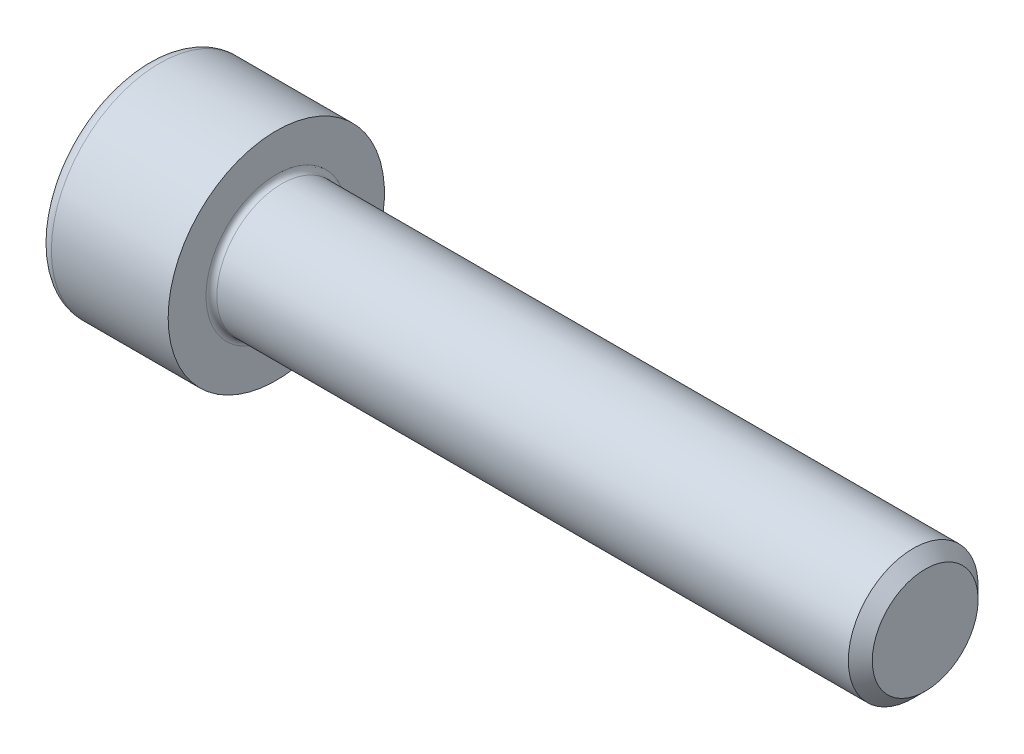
ISO-10303-21;
HEADER;
FILE_DESCRIPTION(('STEP AP214'),'2;1');
FILE_NAME('part.step','',(''),(''),'','','');
FILE_SCHEMA(('AUTOMOTIVE_DESIGN { 1 0 10303 214 1 1 1 1 }'));
ENDSEC;
DATA;
#1=APPLICATION_CONTEXT('core data for automotive mechanical design processes');
#2=APPLICATION_PROTOCOL_DEFINITION('international standard','automotive_design',2000,#1);
#3=PRODUCT_CONTEXT('',#1,'mechanical');
#4=PRODUCT('Part','Part','',(#3));
#5=PRODUCT_RELATED_PRODUCT_CATEGORY('part','',(#4));
#6=PRODUCT_DEFINITION_FORMATION('','',#4);
#7=PRODUCT_DEFINITION_CONTEXT('part definition',#1,'design');
#8=PRODUCT_DEFINITION('design','',#6,#7);
#9=PRODUCT_DEFINITION_SHAPE('','',#8);
#10=(LENGTH_UNIT() NAMED_UNIT(*) SI_UNIT(.MILLI.,.METRE.));
#11=(NAMED_UNIT(*) PLANE_ANGLE_UNIT() SI_UNIT($,.RADIAN.));
#12=(NAMED_UNIT(*) SI_UNIT($,.STERADIAN.) SOLID_ANGLE_UNIT());
#13=UNCERTAINTY_MEASURE_WITH_UNIT(LENGTH_MEASURE(1.E-05),#10,'distance_accuracy_value','');
#14=(GEOMETRIC_REPRESENTATION_CONTEXT(3) GLOBAL_UNCERTAINTY_ASSIGNED_CONTEXT((#13)) GLOBAL_UNIT_ASSIGNED_CONTEXT((#10,
#11,#12)) REPRESENTATION_CONTEXT('',''));
#15=CARTESIAN_POINT('',(0.,0.,0.));
#16=DIRECTION('',(0.,0.,1.));
#17=DIRECTION('',(1.,0.,0.));
#18=AXIS2_PLACEMENT_3D('',#15,#16,#17);
#19=CARTESIAN_POINT('',(0.,0.,0.));
#20=DIRECTION('',(-1.,0.,0.));
#21=DIRECTION('',(0.,0.,1.));
#22=AXIS2_PLACEMENT_3D('',#19,#20,#21);
#23=PLANE('',#22);
#24=DIRECTION('',(0.,-0.499999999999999,0.866025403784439));
#25=VECTOR('',#24,1.);
#26=CARTESIAN_POINT('',(0.,2.89829835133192,0.));
#27=LINE('',#26,#25);
#28=CARTESIAN_POINT('',(0.,2.89829835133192,0.));
#29=VERTEX_POINT('',#28);
#30=CARTESIAN_POINT('',(0.,1.44914917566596,2.50999999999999));
#31=VERTEX_POINT('',#30);
#32=EDGE_CURVE('E286',#29,#31,#27,.T.);
#33=ORIENTED_EDGE('',*,*,#32,.T.);
#34=DIRECTION('',(0.,1.,0.));
#35=VECTOR('',#34,1.);
#36=CARTESIAN_POINT('',(0.,-1.44914917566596,2.51));
#37=LINE('',#36,#35);
#38=CARTESIAN_POINT('',(0.,-1.44914917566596,2.51));
#39=VERTEX_POINT('',#38);
#40=EDGE_CURVE('E143',#39,#31,#37,.T.);
#41=ORIENTED_EDGE('',*,*,#40,.F.);
#42=DIRECTION('',(0.,-0.500000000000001,-0.866025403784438));
#43=VECTOR('',#42,1.);
#44=CARTESIAN_POINT('',(0.,-1.44914917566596,2.51));
#45=LINE('',#44,#43);
#46=CARTESIAN_POINT('',(0.,-2.89829835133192,0.));
#47=VERTEX_POINT('',#46);
#48=EDGE_CURVE('E291',#39,#47,#45,.T.);
#49=ORIENTED_EDGE('',*,*,#48,.T.);
#50=DIRECTION('',(0.,0.499999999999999,-0.866025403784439));
#51=VECTOR('',#50,1.);
#52=CARTESIAN_POINT('',(0.,-2.89829835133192,0.));
#53=LINE('',#52,#51);
#54=CARTESIAN_POINT('',(0.,-1.44914917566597,-2.51));
#55=VERTEX_POINT('',#54);
#56=EDGE_CURVE('E295',#47,#55,#53,.T.);
#57=ORIENTED_EDGE('',*,*,#56,.T.);
#58=DIRECTION('',(0.,-1.,0.));
#59=VECTOR('',#58,1.);
#60=CARTESIAN_POINT('',(0.,1.44914917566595,-2.51));
#61=LINE('',#60,#59);
#62=CARTESIAN_POINT('',(0.,1.44914917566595,-2.51));
#63=VERTEX_POINT('',#62);
#64=EDGE_CURVE('E299',#63,#55,#61,.T.);
#65=ORIENTED_EDGE('',*,*,#64,.F.);
#66=DIRECTION('',(0.,-0.500000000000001,-0.866025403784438));
#67=VECTOR('',#66,1.);
#68=CARTESIAN_POINT('',(0.,2.89829835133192,0.));
#69=LINE('',#68,#67);
#70=EDGE_CURVE('E138',#29,#63,#69,.T.);
#71=ORIENTED_EDGE('',*,*,#70,.F.);
#72=EDGE_LOOP('',(#33,#41,#49,#57,#65,#71));
#73=FACE_BOUND('',#72,.T.);
#74=CARTESIAN_POINT('',(0.,0.,0.));
#75=DIRECTION('',(-1.,0.,0.));
#76=DIRECTION('',(0.,0.,1.));
#77=AXIS2_PLACEMENT_3D('',#74,#75,#76);
#78=CIRCLE('',#77,4.4);
#79=CARTESIAN_POINT('',(0.,0.,4.4));
#80=VERTEX_POINT('',#79);
#81=EDGE_CURVE('E53',#80,#80,#78,.T.);
#82=ORIENTED_EDGE('',*,*,#81,.T.);
#83=EDGE_LOOP('',(#82));
#84=FACE_BOUND('',#83,.T.);
#85=ADVANCED_FACE('F44',(#73,#84),#23,.T.);
#86=CARTESIAN_POINT('',(-31.75,0.,0.));
#87=DIRECTION('',(-1.,0.,0.));
#88=DIRECTION('',(0.,0.,1.));
#89=AXIS2_PLACEMENT_3D('',#86,#87,#88);
#90=CYLINDRICAL_SURFACE('',#89,5.);
#91=CARTESIAN_POINT('',(0.600000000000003,0.,0.));
#92=DIRECTION('',(-1.,0.,0.));
#93=DIRECTION('',(0.,0.,1.));
#94=AXIS2_PLACEMENT_3D('',#91,#92,#93);
#95=CIRCLE('',#94,5.);
#96=CARTESIAN_POINT('',(0.600000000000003,0.,5.));
#97=VERTEX_POINT('',#96);
#98=EDGE_CURVE('E11',#97,#97,#95,.F.);
#99=ORIENTED_EDGE('',*,*,#98,.T.);
#100=EDGE_LOOP('',(#99));
#101=FACE_BOUND('',#100,.T.);
#102=CARTESIAN_POINT('',(6.,0.,0.));
#103=DIRECTION('',(-1.,0.,0.));
#104=DIRECTION('',(0.,0.,1.));
#105=AXIS2_PLACEMENT_3D('',#102,#103,#104);
#106=CIRCLE('',#105,5.);
#107=CARTESIAN_POINT('',(6.,0.,5.));
#108=VERTEX_POINT('',#107);
#109=EDGE_CURVE('E167',#108,#108,#106,.T.);
#110=ORIENTED_EDGE('',*,*,#109,.T.);
#111=EDGE_LOOP('',(#110));
#112=FACE_BOUND('',#111,.T.);
#113=ADVANCED_FACE('F195',(#101,#112),#90,.T.);
#114=CARTESIAN_POINT('',(6.,5.,0.));
#115=DIRECTION('',(1.,0.,0.));
#116=DIRECTION('',(0.,0.,-1.));
#117=AXIS2_PLACEMENT_3D('',#114,#115,#116);
#118=PLANE('',#117);
#119=CARTESIAN_POINT('',(6.,0.,0.));
#120=DIRECTION('',(1.,0.,0.));
#121=DIRECTION('',(0.,0.,-1.));
#122=AXIS2_PLACEMENT_3D('',#119,#120,#121);
#123=CIRCLE('',#122,3.24999999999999);
#124=CARTESIAN_POINT('',(6.,0.,-3.24999999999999));
#125=VERTEX_POINT('',#124);
#126=EDGE_CURVE('E171',#125,#125,#123,.F.);
#127=ORIENTED_EDGE('',*,*,#126,.T.);
#128=EDGE_LOOP('',(#127));
#129=FACE_BOUND('',#128,.T.);
#130=ORIENTED_EDGE('',*,*,#109,.F.);
#131=EDGE_LOOP('',(#130));
#132=FACE_BOUND('',#131,.T.);
#133=ADVANCED_FACE('F201',(#129,#132),#118,.T.);
#134=CARTESIAN_POINT('',(-31.75,0.,0.));
#135=DIRECTION('',(-1.,0.,0.));
#136=DIRECTION('',(0.,0.,1.));
#137=AXIS2_PLACEMENT_3D('',#134,#135,#136);
#138=CYLINDRICAL_SURFACE('',#137,2.99999999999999);
#139=CARTESIAN_POINT('',(6.25,0.,0.));
#140=DIRECTION('',(1.,0.,0.));
#141=DIRECTION('',(0.,0.,-1.));
#142=AXIS2_PLACEMENT_3D('',#139,#140,#141);
#143=CIRCLE('',#142,2.99999999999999);
#144=CARTESIAN_POINT('',(6.25,0.,-2.99999999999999));
#145=VERTEX_POINT('',#144);
#146=EDGE_CURVE('E175',#145,#145,#143,.T.);
#147=ORIENTED_EDGE('',*,*,#146,.T.);
#148=EDGE_LOOP('',(#147));
#149=FACE_BOUND('',#148,.T.);
#150=CARTESIAN_POINT('',(35.4455,0.,0.));
#151=DIRECTION('',(-1.,0.,0.));
#152=DIRECTION('',(0.,0.,1.));
#153=AXIS2_PLACEMENT_3D('',#150,#151,#152);
#154=CIRCLE('',#153,2.99999999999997);
#155=CARTESIAN_POINT('',(35.4455,0.,2.99999999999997));
#156=VERTEX_POINT('',#155);
#157=EDGE_CURVE('E163',#156,#156,#154,.T.);
#158=ORIENTED_EDGE('',*,*,#157,.T.);
#159=EDGE_LOOP('',(#158));
#160=FACE_BOUND('',#159,.T.);
#161=ADVANCED_FACE('F207',(#149,#160),#138,.T.);
#162=CARTESIAN_POINT('',(36.,0.,0.));
#163=DIRECTION('',(-1.,0.,0.));
#164=DIRECTION('',(0.,0.,1.));
#165=AXIS2_PLACEMENT_3D('',#162,#163,#164);
#166=CONICAL_SURFACE('',#165,2.4455,0.785398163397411);
#167=ORIENTED_EDGE('',*,*,#157,.F.);
#168=EDGE_LOOP('',(#167));
#169=FACE_BOUND('',#168,.T.);
#170=CARTESIAN_POINT('',(36.,0.,0.));
#171=DIRECTION('',(-1.,0.,0.));
#172=DIRECTION('',(0.,0.,1.));
#173=AXIS2_PLACEMENT_3D('',#170,#171,#172);
#174=CIRCLE('',#173,2.4455);
#175=CARTESIAN_POINT('',(36.,0.,2.4455));
#176=VERTEX_POINT('',#175);
#177=EDGE_CURVE('E158',#176,#176,#174,.T.);
#178=ORIENTED_EDGE('',*,*,#177,.T.);
#179=EDGE_LOOP('',(#178));
#180=FACE_BOUND('',#179,.T.);
#181=ADVANCED_FACE('F211',(#169,#180),#166,.T.);
#182=CARTESIAN_POINT('',(36.,2.4455,0.));
#183=DIRECTION('',(1.,0.,0.));
#184=DIRECTION('',(0.,0.,-1.));
#185=AXIS2_PLACEMENT_3D('',#182,#183,#184);
#186=PLANE('',#185);
#187=ORIENTED_EDGE('',*,*,#177,.F.);
#188=EDGE_LOOP('',(#187));
#189=FACE_BOUND('',#188,.T.);
#190=ADVANCED_FACE('F191',(#189),#186,.T.);
#191=CARTESIAN_POINT('',(6.25,0.,0.));
#192=DIRECTION('',(1.,0.,0.));
#193=DIRECTION('',(0.,0.,-1.));
#194=AXIS2_PLACEMENT_3D('',#191,#192,#193);
#195=TOROIDAL_SURFACE('',#194,3.24999999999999,0.25);
#196=ORIENTED_EDGE('',*,*,#146,.F.);
#197=EDGE_LOOP('',(#196));
#198=FACE_BOUND('',#197,.T.);
#199=ORIENTED_EDGE('',*,*,#126,.F.);
#200=EDGE_LOOP('',(#199));
#201=FACE_BOUND('',#200,.T.);
#202=ADVANCED_FACE('F184',(#198,#201),#195,.F.);
#203=CARTESIAN_POINT('',(0.600000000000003,0.,0.));
#204=DIRECTION('',(-1.,0.,0.));
#205=DIRECTION('',(0.,0.,1.));
#206=AXIS2_PLACEMENT_3D('',#203,#204,#205);
#207=TOROIDAL_SURFACE('',#206,4.4,0.6);
#208=ORIENTED_EDGE('',*,*,#98,.F.);
#209=EDGE_LOOP('',(#208));
#210=FACE_BOUND('',#209,.T.);
#211=ORIENTED_EDGE('',*,*,#81,.F.);
#212=EDGE_LOOP('',(#211));
#213=FACE_BOUND('',#212,.T.);
#214=ADVANCED_FACE('F46',(#210,#213),#207,.T.);
#215=CARTESIAN_POINT('',(3.,2.89829835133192,0.));
#216=DIRECTION('',(0.,-0.866025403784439,-0.499999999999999));
#217=DIRECTION('',(0.,0.499999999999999,-0.866025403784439));
#218=AXIS2_PLACEMENT_3D('',#215,#216,#217);
#219=PLANE('',#218);
#220=ORIENTED_EDGE('',*,*,#32,.F.);
#221=DIRECTION('',(-1.,0.,0.));
#222=VECTOR('',#221,1.);
#223=CARTESIAN_POINT('',(3.,2.89829835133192,0.));
#224=LINE('',#223,#222);
#225=CARTESIAN_POINT('',(3.,2.89829835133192,0.));
#226=VERTEX_POINT('',#225);
#227=EDGE_CURVE('E273',#226,#29,#224,.T.);
#228=ORIENTED_EDGE('',*,*,#227,.F.);
#229=DIRECTION('',(0.,-0.499999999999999,0.866025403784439));
#230=VECTOR('',#229,1.);
#231=CARTESIAN_POINT('',(3.,2.89829835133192,0.));
#232=LINE('',#231,#230);
#233=CARTESIAN_POINT('',(3.,2.17372376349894,1.25499999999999));
#234=VERTEX_POINT('',#233);
#235=EDGE_CURVE('E129',#226,#234,#232,.T.);
#236=ORIENTED_EDGE('',*,*,#235,.T.);
#237=CARTESIAN_POINT('',(3.,1.44914917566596,2.50999999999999));
#238=VERTEX_POINT('',#237);
#239=EDGE_CURVE('E119',#234,#238,#232,.T.);
#240=ORIENTED_EDGE('',*,*,#239,.T.);
#241=DIRECTION('',(-1.,0.,0.));
#242=VECTOR('',#241,1.);
#243=CARTESIAN_POINT('',(3.,1.44914917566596,2.50999999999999));
#244=LINE('',#243,#242);
#245=EDGE_CURVE('E134',#238,#31,#244,.T.);
#246=ORIENTED_EDGE('',*,*,#245,.T.);
#247=EDGE_LOOP('',(#220,#228,#236,#240,#246));
#248=FACE_BOUND('',#247,.T.);
#249=ADVANCED_FACE('F133',(#248),#219,.T.);
#250=CARTESIAN_POINT('',(3.,-1.44914917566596,2.51));
#251=DIRECTION('',(0.,0.,1.));
#252=DIRECTION('',(0.,-1.,0.));
#253=AXIS2_PLACEMENT_3D('',#250,#251,#252);
#254=PLANE('',#253);
#255=ORIENTED_EDGE('',*,*,#40,.T.);
#256=ORIENTED_EDGE('',*,*,#245,.F.);
#257=DIRECTION('',(0.,1.,0.));
#258=VECTOR('',#257,1.);
#259=CARTESIAN_POINT('',(3.,-1.44914917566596,2.51));
#260=LINE('',#259,#258);
#261=CARTESIAN_POINT('',(3.,0.,2.51));
#262=VERTEX_POINT('',#261);
#263=EDGE_CURVE('E116',#262,#238,#260,.T.);
#264=ORIENTED_EDGE('',*,*,#263,.F.);
#265=CARTESIAN_POINT('',(3.,-1.44914917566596,2.51));
#266=VERTEX_POINT('',#265);
#267=EDGE_CURVE('E128',#266,#262,#260,.T.);
#268=ORIENTED_EDGE('',*,*,#267,.F.);
#269=DIRECTION('',(-1.,0.,0.));
#270=VECTOR('',#269,1.);
#271=CARTESIAN_POINT('',(3.,-1.44914917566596,2.51));
#272=LINE('',#271,#270);
#273=EDGE_CURVE('E146',#266,#39,#272,.T.);
#274=ORIENTED_EDGE('',*,*,#273,.T.);
#275=EDGE_LOOP('',(#255,#256,#264,#268,#274));
#276=FACE_BOUND('',#275,.T.);
#277=ADVANCED_FACE('F140',(#276),#254,.F.);
#278=CARTESIAN_POINT('',(3.,-1.44914917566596,2.51));
#279=DIRECTION('',(0.,0.866025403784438,-0.500000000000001));
#280=DIRECTION('',(0.,0.500000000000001,0.866025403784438));
#281=AXIS2_PLACEMENT_3D('',#278,#279,#280);
#282=PLANE('',#281);
#283=ORIENTED_EDGE('',*,*,#48,.F.);
#284=ORIENTED_EDGE('',*,*,#273,.F.);
#285=DIRECTION('',(0.,-0.500000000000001,-0.866025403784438));
#286=VECTOR('',#285,1.);
#287=CARTESIAN_POINT('',(3.,-1.44914917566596,2.51));
#288=LINE('',#287,#286);
#289=CARTESIAN_POINT('',(3.,-2.17372376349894,1.255));
#290=VERTEX_POINT('',#289);
#291=EDGE_CURVE('E329',#266,#290,#288,.T.);
#292=ORIENTED_EDGE('',*,*,#291,.T.);
#293=CARTESIAN_POINT('',(3.,-2.89829835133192,0.));
#294=VERTEX_POINT('',#293);
#295=EDGE_CURVE('E313',#290,#294,#288,.T.);
#296=ORIENTED_EDGE('',*,*,#295,.T.);
#297=DIRECTION('',(-1.,0.,0.));
#298=VECTOR('',#297,1.);
#299=CARTESIAN_POINT('',(3.,-2.89829835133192,0.));
#300=LINE('',#299,#298);
#301=EDGE_CURVE('E153',#294,#47,#300,.T.);
#302=ORIENTED_EDGE('',*,*,#301,.T.);
#303=EDGE_LOOP('',(#283,#284,#292,#296,#302));
#304=FACE_BOUND('',#303,.T.);
#305=ADVANCED_FACE('F225',(#304),#282,.T.);
#306=CARTESIAN_POINT('',(3.,-2.89829835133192,0.));
#307=DIRECTION('',(0.,0.866025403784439,0.499999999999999));
#308=DIRECTION('',(0.,-0.499999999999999,0.866025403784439));
#309=AXIS2_PLACEMENT_3D('',#306,#307,#308);
#310=PLANE('',#309);
#311=ORIENTED_EDGE('',*,*,#56,.F.);
#312=ORIENTED_EDGE('',*,*,#301,.F.);
#313=DIRECTION('',(0.,0.499999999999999,-0.866025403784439));
#314=VECTOR('',#313,1.);
#315=CARTESIAN_POINT('',(3.,-2.89829835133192,0.));
#316=LINE('',#315,#314);
#317=CARTESIAN_POINT('',(3.,-2.17372376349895,-1.255));
#318=VERTEX_POINT('',#317);
#319=EDGE_CURVE('E281',#294,#318,#316,.T.);
#320=ORIENTED_EDGE('',*,*,#319,.T.);
#321=CARTESIAN_POINT('',(3.,-1.44914917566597,-2.51));
#322=VERTEX_POINT('',#321);
#323=EDGE_CURVE('E327',#318,#322,#316,.T.);
#324=ORIENTED_EDGE('',*,*,#323,.T.);
#325=DIRECTION('',(-1.,0.,0.));
#326=VECTOR('',#325,1.);
#327=CARTESIAN_POINT('',(3.,-1.44914917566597,-2.51));
#328=LINE('',#327,#326);
#329=EDGE_CURVE('E272',#322,#55,#328,.T.);
#330=ORIENTED_EDGE('',*,*,#329,.T.);
#331=EDGE_LOOP('',(#311,#312,#320,#324,#330));
#332=FACE_BOUND('',#331,.T.);
#333=ADVANCED_FACE('F228',(#332),#310,.T.);
#334=CARTESIAN_POINT('',(3.,1.44914917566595,-2.51));
#335=DIRECTION('',(0.,0.,-1.));
#336=DIRECTION('',(0.,1.,0.));
#337=AXIS2_PLACEMENT_3D('',#334,#335,#336);
#338=PLANE('',#337);
#339=ORIENTED_EDGE('',*,*,#64,.T.);
#340=ORIENTED_EDGE('',*,*,#329,.F.);
#341=DIRECTION('',(0.,-1.,0.));
#342=VECTOR('',#341,1.);
#343=CARTESIAN_POINT('',(3.,1.44914917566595,-2.51));
#344=LINE('',#343,#342);
#345=CARTESIAN_POINT('',(3.,0.,-2.51));
#346=VERTEX_POINT('',#345);
#347=EDGE_CURVE('E276',#346,#322,#344,.T.);
#348=ORIENTED_EDGE('',*,*,#347,.F.);
#349=CARTESIAN_POINT('',(3.,1.44914917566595,-2.51));
#350=VERTEX_POINT('',#349);
#351=EDGE_CURVE('E60',#350,#346,#344,.T.);
#352=ORIENTED_EDGE('',*,*,#351,.F.);
#353=DIRECTION('',(-1.,0.,0.));
#354=VECTOR('',#353,1.);
#355=CARTESIAN_POINT('',(3.,1.44914917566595,-2.51));
#356=LINE('',#355,#354);
#357=EDGE_CURVE('E268',#350,#63,#356,.T.);
#358=ORIENTED_EDGE('',*,*,#357,.T.);
#359=EDGE_LOOP('',(#339,#340,#348,#352,#358));
#360=FACE_BOUND('',#359,.T.);
#361=ADVANCED_FACE('F232',(#360),#338,.F.);
#362=CARTESIAN_POINT('',(3.,2.89829835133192,0.));
#363=DIRECTION('',(0.,0.866025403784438,-0.500000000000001));
#364=DIRECTION('',(0.,0.500000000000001,0.866025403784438));
#365=AXIS2_PLACEMENT_3D('',#362,#363,#364);
#366=PLANE('',#365);
#367=ORIENTED_EDGE('',*,*,#70,.T.);
#368=ORIENTED_EDGE('',*,*,#357,.F.);
#369=DIRECTION('',(0.,-0.500000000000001,-0.866025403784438));
#370=VECTOR('',#369,1.);
#371=CARTESIAN_POINT('',(3.,2.89829835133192,0.));
#372=LINE('',#371,#370);
#373=CARTESIAN_POINT('',(3.,2.17372376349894,-1.255));
#374=VERTEX_POINT('',#373);
#375=EDGE_CURVE('E257',#374,#350,#372,.T.);
#376=ORIENTED_EDGE('',*,*,#375,.F.);
#377=EDGE_CURVE('E264',#226,#374,#372,.T.);
#378=ORIENTED_EDGE('',*,*,#377,.F.);
#379=ORIENTED_EDGE('',*,*,#227,.T.);
#380=EDGE_LOOP('',(#367,#368,#376,#378,#379));
#381=FACE_BOUND('',#380,.T.);
#382=ADVANCED_FACE('F236',(#381),#366,.F.);
#383=CARTESIAN_POINT('',(3.,4.34744752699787,-2.51000000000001));
#384=DIRECTION('',(1.,0.,0.));
#385=DIRECTION('',(0.,0.,-1.));
#386=AXIS2_PLACEMENT_3D('',#383,#384,#385);
#387=PLANE('',#386);
#388=ORIENTED_EDGE('',*,*,#347,.T.);
#389=ORIENTED_EDGE('',*,*,#323,.F.);
#390=CARTESIAN_POINT('',(3.,0.,0.));
#391=DIRECTION('',(-1.,0.,0.));
#392=DIRECTION('',(0.,0.,1.));
#393=AXIS2_PLACEMENT_3D('',#390,#391,#392);
#394=CIRCLE('',#393,2.51);
#395=EDGE_CURVE('E321',#346,#318,#394,.T.);
#396=ORIENTED_EDGE('',*,*,#395,.F.);
#397=EDGE_LOOP('',(#388,#389,#396));
#398=FACE_BOUND('',#397,.T.);
#399=ADVANCED_FACE('F240',(#398),#387,.F.);
#400=ORIENTED_EDGE('',*,*,#319,.F.);
#401=ORIENTED_EDGE('',*,*,#295,.F.);
#402=EDGE_CURVE('E151',#318,#290,#394,.T.);
#403=ORIENTED_EDGE('',*,*,#402,.F.);
#404=EDGE_LOOP('',(#400,#401,#403));
#405=FACE_BOUND('',#404,.T.);
#406=ADVANCED_FACE('F243',(#405),#387,.F.);
#407=ORIENTED_EDGE('',*,*,#291,.F.);
#408=ORIENTED_EDGE('',*,*,#267,.T.);
#409=EDGE_CURVE('E145',#290,#262,#394,.T.);
#410=ORIENTED_EDGE('',*,*,#409,.F.);
#411=EDGE_LOOP('',(#407,#408,#410));
#412=FACE_BOUND('',#411,.T.);
#413=ADVANCED_FACE('F248',(#412),#387,.F.);
#414=ORIENTED_EDGE('',*,*,#263,.T.);
#415=ORIENTED_EDGE('',*,*,#239,.F.);
#416=EDGE_CURVE('E122',#262,#234,#394,.T.);
#417=ORIENTED_EDGE('',*,*,#416,.F.);
#418=EDGE_LOOP('',(#414,#415,#417));
#419=FACE_BOUND('',#418,.T.);
#420=ADVANCED_FACE('F118',(#419),#387,.F.);
#421=ORIENTED_EDGE('',*,*,#235,.F.);
#422=ORIENTED_EDGE('',*,*,#377,.T.);
#423=EDGE_CURVE('E159',#234,#374,#394,.T.);
#424=ORIENTED_EDGE('',*,*,#423,.F.);
#425=EDGE_LOOP('',(#421,#422,#424));
#426=FACE_BOUND('',#425,.T.);
#427=ADVANCED_FACE('F251',(#426),#387,.F.);
#428=ORIENTED_EDGE('',*,*,#375,.T.);
#429=ORIENTED_EDGE('',*,*,#351,.T.);
#430=EDGE_CURVE('E260',#374,#346,#394,.T.);
#431=ORIENTED_EDGE('',*,*,#430,.F.);
#432=EDGE_LOOP('',(#428,#429,#431));
#433=FACE_BOUND('',#432,.T.);
#434=ADVANCED_FACE('F221',(#433),#387,.F.);
#435=CARTESIAN_POINT('',(3.,0.,0.));
#436=DIRECTION('',(-1.,0.,0.));
#437=DIRECTION('',(0.,0.,1.));
#438=AXIS2_PLACEMENT_3D('',#435,#436,#437);
#439=CONICAL_SURFACE('',#438,2.51,1.04719755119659);
#440=CARTESIAN_POINT('',(4.44914917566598,0.,0.));
#441=VERTEX_POINT('',#440);
#442=VERTEX_LOOP('',#441);
#443=FACE_BOUND('',#442,.T.);
#444=ORIENTED_EDGE('',*,*,#416,.T.);
#445=ORIENTED_EDGE('',*,*,#423,.T.);
#446=ORIENTED_EDGE('',*,*,#430,.T.);
#447=ORIENTED_EDGE('',*,*,#395,.T.);
#448=ORIENTED_EDGE('',*,*,#402,.T.);
#449=ORIENTED_EDGE('',*,*,#409,.T.);
#450=EDGE_LOOP('',(#444,#445,#446,#447,#448,#449));
#451=FACE_BOUND('',#450,.T.);
#452=ADVANCED_FACE('F219',(#443,#451),#439,.F.);
#453=CLOSED_SHELL('',(#85,#113,#133,#161,#181,#190,#202,#214,#249,#277,#305,#333,#361,#382,#399,
#406,#413,#420,#427,#434,#452));
#454=MANIFOLD_SOLID_BREP('B2',#453);
#455=ADVANCED_BREP_SHAPE_REPRESENTATION('',(#18,#454),#14);
#456=SHAPE_DEFINITION_REPRESENTATION(#9,#455);
ENDSEC;
END-ISO-10303-21;
